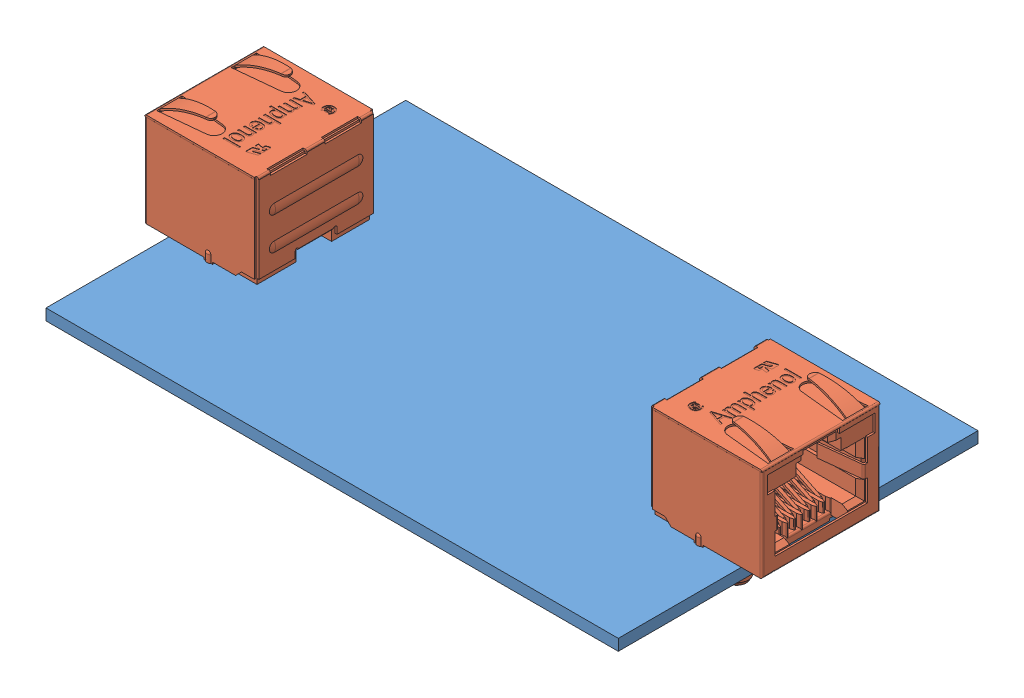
SolidWorks assembly 10-610046-100 Rev B.SLDASM, configuration Default (file format 10000). Lengths in mm.
Overall size (86.36 18.85 50.29).
3 component instances, 2 part files, 2 mates.
Components (placement in the parent):
- 12-610046-100 Rev B-1: 12-610046-100 Rev B.SLDPRT [Default] at (25.3461 42.5897 63.2314) size (80.01 1.57 50.29)
- M-RJHSE-5380-REVT1-1: M-RJHSE-5380-REVT1.SLDPRT [Default] at (62.1127 47.2357 63.1533) x (0 0 -1) z (1 0 0) size (16.83 18.85 15.92)
- M-RJHSE-5380-REVT1-2: M-RJHSE-5380-REVT1.SLDPRT [Default] at (-11.3592 47.2357 63.2791) x (0 0 1) z (-1 0 0) size (16.83 18.85 15.92)
Mates (geometry in assembly coordinates):
- Coincident1: coincident anti-aligned: plane of 12-610046-100 Rev B-1 through (25.3461 44.1645 63.2314) normal (0 1 0); plane of M-RJHSE-5380-REVT1-1 through (55.5083 44.1645 69.3122) normal (0 -1 0)
- Coincident2: coincident anti-aligned: plane of 12-610046-100 Rev B-1 through (25.3461 44.1645 63.2314) normal (0 1 0); plane of M-RJHSE-5380-REVT1-2 through (-4.7549 44.1645 57.1202) normal (0 -1 0)
